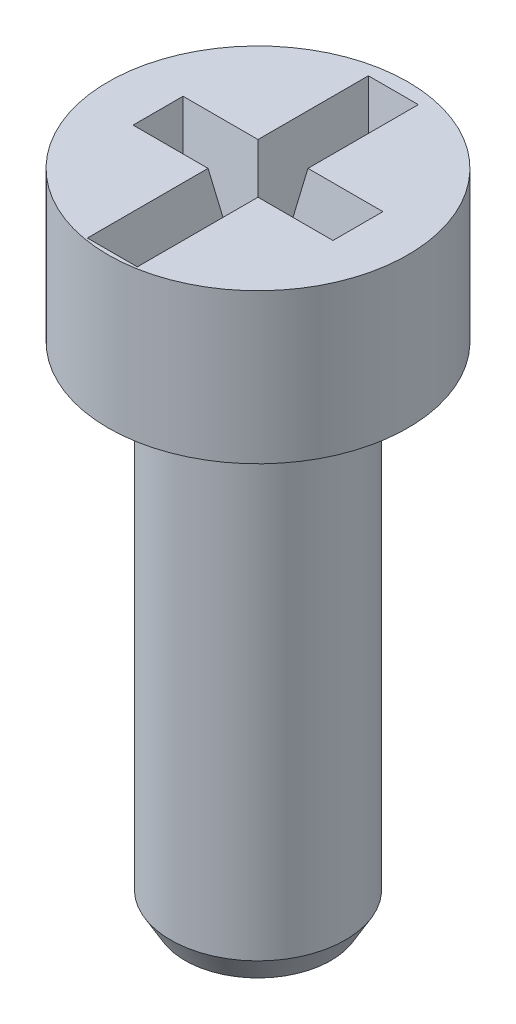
from build123d import *

# Parameters (mm, degrees)
CHANFREIN1_SIZE         = 0.288675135
CHANFREIN1_SIZE2        = 0.5
ENL_V_MAT_EXTRU_1_DEPTH = 1.5
ENL_V_MAT_EXTRU_1_DRAFT = -10


with BuildPart() as part:
    # Esquisse1 → R_volution1 (revolve)
    with BuildSketch(Plane.XY, mode=Mode.PRIVATE) as r_volution1_sk:
        Polygon((0, 0), (1.75, 0), (1.75, 10), (3, 10), (3, 13), (0, 13), align=None)
    revolve(r_volution1_sk.sketch.rotate(Axis((0, 0, 0), (0, 1, 0)), 90), axis=Axis((0, 0, 0), (0, 1, 0)))

    # Chanfrein1
    chanfrein1_edges = [part.edges().sort_by_distance(p)[0] for p in [
        (0, 0, 1.75),
    ]]
    chanfrein1_side = [part.faces().sort_by_distance(p)[0] for p in [
        (0, 0, 0),
    ]]
    chamfer(chanfrein1_edges, length=CHANFREIN1_SIZE, length2=CHANFREIN1_SIZE2, reference=chanfrein1_side[0])


with BuildPart() as enl_v_mat_extru_1_tool:
    # Esquisse2 → Enl_v. mat.-Extru.1 (with draft: the straight prism first)
    with BuildSketch(Plane(origin=(0, 13, 0), x_dir=(-1, 0, 0), z_dir=(0, 1, 0))):
        Polygon((-0.5, -2.708978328), (0.5, -2.708978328), (0.5, -0.5), (2, -0.5), (2, 0.5), (0.5, 0.5), (0.5, 2.915376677), (-0.5, 2.915376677), (-0.5, 0.5), (-2, 0.5), (-2, -0.5), (-0.5, -0.5), align=None)
    extrude(amount=-ENL_V_MAT_EXTRU_1_DEPTH)
    # Enl_v. mat.-Extru.1: the draft: its side faces are tilted about the plane it starts from
    enl_v_mat_extru_1_sides = [enl_v_mat_extru_1_tool.faces().sort_by_distance(p)[0] for p in [
        (0, 12.25, -2.708978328),
        (-0.5, 12.25, -1.604489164),
        (-1.25, 12.25, -0.5),
        (-2, 12.25, 0),
        (-1.25, 12.25, 0.5),
        (-0.5, 12.25, 1.707688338),
        (0, 12.25, 2.915376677),
        (0.5, 12.25, 1.707688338),
        (1.25, 12.25, 0.5),
        (2, 12.25, 0),
        (1.25, 12.25, -0.5),
        (0.5, 12.25, -1.604489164),
    ]]
    draft(enl_v_mat_extru_1_sides, Plane(origin=(0, 13, 0), x_dir=(-1, 0, 0), z_dir=(0, 1, 0)), ENL_V_MAT_EXTRU_1_DRAFT)


with BuildPart() as part_1:
    add(part.part)

    # Enl_v. mat.-Extru.1: cut by enl_v_mat_extru_1_tool
    add(enl_v_mat_extru_1_tool.part, mode=Mode.SUBTRACT)


solid = part_1.part
